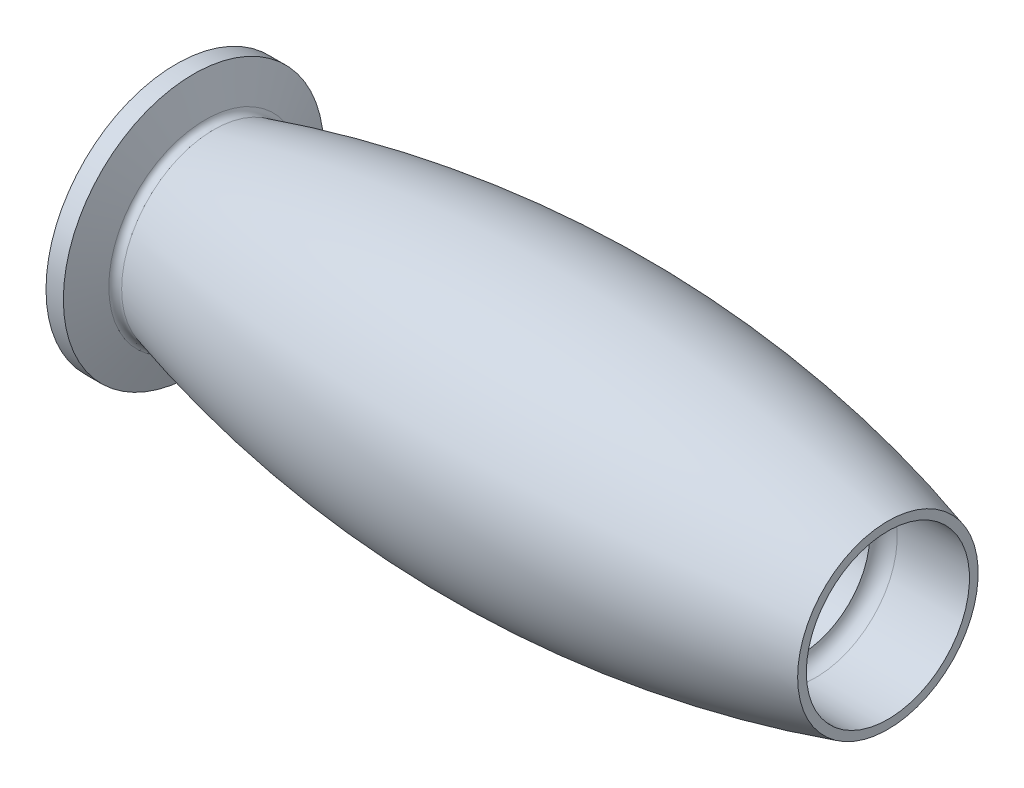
ISO-10303-21;
HEADER;
FILE_DESCRIPTION(('STEP AP214'),'2;1');
FILE_NAME('part.step','',(''),(''),'','','');
FILE_SCHEMA(('AUTOMOTIVE_DESIGN { 1 0 10303 214 1 1 1 1 }'));
ENDSEC;
DATA;
#1=APPLICATION_CONTEXT('core data for automotive mechanical design processes');
#2=APPLICATION_PROTOCOL_DEFINITION('international standard','automotive_design',2000,#1);
#3=PRODUCT_CONTEXT('',#1,'mechanical');
#4=PRODUCT('Part','Part','',(#3));
#5=PRODUCT_RELATED_PRODUCT_CATEGORY('part','',(#4));
#6=PRODUCT_DEFINITION_FORMATION('','',#4);
#7=PRODUCT_DEFINITION_CONTEXT('part definition',#1,'design');
#8=PRODUCT_DEFINITION('design','',#6,#7);
#9=PRODUCT_DEFINITION_SHAPE('','',#8);
#10=(LENGTH_UNIT() NAMED_UNIT(*) SI_UNIT(.MILLI.,.METRE.));
#11=(NAMED_UNIT(*) PLANE_ANGLE_UNIT() SI_UNIT($,.RADIAN.));
#12=(NAMED_UNIT(*) SI_UNIT($,.STERADIAN.) SOLID_ANGLE_UNIT());
#13=UNCERTAINTY_MEASURE_WITH_UNIT(LENGTH_MEASURE(1.E-05),#10,'distance_accuracy_value','');
#14=(GEOMETRIC_REPRESENTATION_CONTEXT(3) GLOBAL_UNCERTAINTY_ASSIGNED_CONTEXT((#13)) GLOBAL_UNIT_ASSIGNED_CONTEXT((#10,
#11,#12)) REPRESENTATION_CONTEXT('',''));
#15=CARTESIAN_POINT('',(0.,0.,0.));
#16=DIRECTION('',(0.,0.,1.));
#17=DIRECTION('',(1.,0.,0.));
#18=AXIS2_PLACEMENT_3D('',#15,#16,#17);
#19=CARTESIAN_POINT('',(-20.,0.,0.));
#20=DIRECTION('',(-1.,0.,0.));
#21=DIRECTION('',(0.,0.,1.));
#22=AXIS2_PLACEMENT_3D('',#19,#20,#21);
#23=CYLINDRICAL_SURFACE('',#22,12.);
#24=CARTESIAN_POINT('',(4.00000000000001,0.,0.));
#25=DIRECTION('',(-1.,0.,0.));
#26=DIRECTION('',(0.,0.,1.));
#27=AXIS2_PLACEMENT_3D('',#24,#25,#26);
#28=CIRCLE('',#27,12.);
#29=CARTESIAN_POINT('',(4.00000000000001,0.,12.));
#30=VERTEX_POINT('',#29);
#31=EDGE_CURVE('E48',#30,#30,#28,.T.);
#32=ORIENTED_EDGE('',*,*,#31,.T.);
#33=EDGE_LOOP('',(#32));
#34=FACE_BOUND('',#33,.T.);
#35=CARTESIAN_POINT('',(7.00000000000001,0.,0.));
#36=DIRECTION('',(-1.,0.,0.));
#37=DIRECTION('',(0.,0.,1.));
#38=AXIS2_PLACEMENT_3D('',#35,#36,#37);
#39=CIRCLE('',#38,12.);
#40=CARTESIAN_POINT('',(7.00000000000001,0.,12.));
#41=VERTEX_POINT('',#40);
#42=EDGE_CURVE('E86',#41,#41,#39,.T.);
#43=ORIENTED_EDGE('',*,*,#42,.F.);
#44=EDGE_LOOP('',(#43));
#45=FACE_BOUND('',#44,.T.);
#46=ADVANCED_FACE('F33',(#34,#45),#23,.F.);
#47=CARTESIAN_POINT('',(4.00000000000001,0.,0.));
#48=DIRECTION('',(1.,0.,0.));
#49=DIRECTION('',(0.,0.,-1.));
#50=AXIS2_PLACEMENT_3D('',#47,#48,#49);
#51=CONICAL_SURFACE('',#50,12.,1.21609067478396);
#52=CARTESIAN_POINT('',(6.50000000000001,0.,0.));
#53=DIRECTION('',(-1.,0.,0.));
#54=DIRECTION('',(0.,0.,1.));
#55=AXIS2_PLACEMENT_3D('',#52,#53,#54);
#56=CIRCLE('',#55,18.75);
#57=CARTESIAN_POINT('',(6.50000000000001,0.,18.75));
#58=VERTEX_POINT('',#57);
#59=EDGE_CURVE('E53',#58,#58,#56,.T.);
#60=ORIENTED_EDGE('',*,*,#59,.T.);
#61=EDGE_LOOP('',(#60));
#62=FACE_BOUND('',#61,.T.);
#63=ORIENTED_EDGE('',*,*,#31,.F.);
#64=EDGE_LOOP('',(#63));
#65=FACE_BOUND('',#64,.T.);
#66=ADVANCED_FACE('F94',(#62,#65),#51,.T.);
#67=CARTESIAN_POINT('',(-20.,0.,0.));
#68=DIRECTION('',(-1.,0.,0.));
#69=DIRECTION('',(0.,0.,1.));
#70=AXIS2_PLACEMENT_3D('',#67,#68,#69);
#71=CYLINDRICAL_SURFACE('',#70,18.75);
#72=CARTESIAN_POINT('',(9.00000000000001,0.,0.));
#73=DIRECTION('',(-1.,0.,0.));
#74=DIRECTION('',(0.,0.,1.));
#75=AXIS2_PLACEMENT_3D('',#72,#73,#74);
#76=CIRCLE('',#75,18.75);
#77=CARTESIAN_POINT('',(9.00000000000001,0.,18.75));
#78=VERTEX_POINT('',#77);
#79=EDGE_CURVE('E56',#78,#78,#76,.T.);
#80=ORIENTED_EDGE('',*,*,#79,.T.);
#81=EDGE_LOOP('',(#80));
#82=FACE_BOUND('',#81,.T.);
#83=ORIENTED_EDGE('',*,*,#59,.F.);
#84=EDGE_LOOP('',(#83));
#85=FACE_BOUND('',#84,.T.);
#86=ADVANCED_FACE('F100',(#82,#85),#71,.T.);
#87=CARTESIAN_POINT('',(9.00000000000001,0.,0.));
#88=DIRECTION('',(-1.,0.,0.));
#89=DIRECTION('',(0.,0.,1.));
#90=AXIS2_PLACEMENT_3D('',#87,#88,#89);
#91=CONICAL_SURFACE('',#90,18.75,1.23605948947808);
#92=CARTESIAN_POINT('',(10.6886470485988,0.,0.));
#93=DIRECTION('',(-1.,0.,0.));
#94=DIRECTION('',(0.,0.,1.));
#95=AXIS2_PLACEMENT_3D('',#92,#93,#94);
#96=CIRCLE('',#95,13.8951397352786);
#97=CARTESIAN_POINT('',(10.6886470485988,0.,13.8951397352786));
#98=VERTEX_POINT('',#97);
#99=EDGE_CURVE('E59',#98,#98,#96,.T.);
#100=ORIENTED_EDGE('',*,*,#99,.T.);
#101=EDGE_LOOP('',(#100));
#102=FACE_BOUND('',#101,.T.);
#103=ORIENTED_EDGE('',*,*,#79,.F.);
#104=EDGE_LOOP('',(#103));
#105=FACE_BOUND('',#104,.T.);
#106=ADVANCED_FACE('F158',(#102,#105),#91,.T.);
#107=CARTESIAN_POINT('',(11.6331438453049,0.,0.));
#108=DIRECTION('',(-1.,0.,0.));
#109=DIRECTION('',(0.,0.,1.));
#110=AXIS2_PLACEMENT_3D('',#107,#108,#109);
#111=TOROIDAL_SURFACE('',#110,14.2236603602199,1.00000000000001);
#112=CARTESIAN_POINT('',(11.907955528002,0.,0.));
#113=DIRECTION('',(-1.,0.,0.));
#114=DIRECTION('',(0.,0.,1.));
#115=AXIS2_PLACEMENT_3D('',#112,#113,#114);
#116=CIRCLE('',#115,13.2621622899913);
#117=CARTESIAN_POINT('',(11.907955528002,0.,13.2621622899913));
#118=VERTEX_POINT('',#117);
#119=EDGE_CURVE('E62',#118,#118,#116,.T.);
#120=ORIENTED_EDGE('',*,*,#119,.T.);
#121=EDGE_LOOP('',(#120));
#122=FACE_BOUND('',#121,.T.);
#123=ORIENTED_EDGE('',*,*,#99,.F.);
#124=EDGE_LOOP('',(#123));
#125=FACE_BOUND('',#124,.T.);
#126=ADVANCED_FACE('F154',(#122,#125),#111,.F.);
#127=CARTESIAN_POINT('',(60.,0.,0.));
#128=DIRECTION('',(-1.,0.,0.));
#129=DIRECTION('',(0.,0.,1.));
#130=AXIS2_PLACEMENT_3D('',#127,#128,#129);
#131=DEGENERATE_TOROIDAL_SURFACE('',#130,155.000000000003,175.000000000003,.F.);
#132=CARTESIAN_POINT('',(109.,0.,0.));
#133=DIRECTION('',(-1.,0.,0.));
#134=DIRECTION('',(0.,0.,1.));
#135=AXIS2_PLACEMENT_3D('',#132,#133,#134);
#136=CIRCLE('',#135,13.0000000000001);
#137=CARTESIAN_POINT('',(109.,0.,13.0000000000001));
#138=VERTEX_POINT('',#137);
#139=EDGE_CURVE('E65',#138,#138,#136,.T.);
#140=ORIENTED_EDGE('',*,*,#139,.T.);
#141=EDGE_LOOP('',(#140));
#142=FACE_BOUND('',#141,.T.);
#143=ORIENTED_EDGE('',*,*,#119,.F.);
#144=EDGE_LOOP('',(#143));
#145=FACE_BOUND('',#144,.T.);
#146=ADVANCED_FACE('F150',(#142,#145),#131,.F.);
#147=CARTESIAN_POINT('',(109.,-13.,0.));
#148=DIRECTION('',(1.,0.,0.));
#149=DIRECTION('',(0.,0.,-1.));
#150=AXIS2_PLACEMENT_3D('',#147,#148,#149);
#151=PLANE('',#150);
#152=CARTESIAN_POINT('',(109.,0.,0.));
#153=DIRECTION('',(-1.,0.,0.));
#154=DIRECTION('',(0.,0.,1.));
#155=AXIS2_PLACEMENT_3D('',#152,#153,#154);
#156=CIRCLE('',#155,11.75);
#157=CARTESIAN_POINT('',(109.,0.,11.75));
#158=VERTEX_POINT('',#157);
#159=EDGE_CURVE('E68',#158,#158,#156,.T.);
#160=ORIENTED_EDGE('',*,*,#159,.T.);
#161=EDGE_LOOP('',(#160));
#162=FACE_BOUND('',#161,.T.);
#163=ORIENTED_EDGE('',*,*,#139,.F.);
#164=EDGE_LOOP('',(#163));
#165=FACE_BOUND('',#164,.T.);
#166=ADVANCED_FACE('F145',(#162,#165),#151,.T.);
#167=CARTESIAN_POINT('',(-20.,0.,0.));
#168=DIRECTION('',(-1.,0.,0.));
#169=DIRECTION('',(0.,0.,1.));
#170=AXIS2_PLACEMENT_3D('',#167,#168,#169);
#171=CYLINDRICAL_SURFACE('',#170,11.75);
#172=CARTESIAN_POINT('',(98.593741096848,0.,0.));
#173=DIRECTION('',(-1.,0.,0.));
#174=DIRECTION('',(0.,0.,1.));
#175=AXIS2_PLACEMENT_3D('',#172,#173,#174);
#176=CIRCLE('',#175,11.75);
#177=CARTESIAN_POINT('',(98.593741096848,0.,11.75));
#178=VERTEX_POINT('',#177);
#179=EDGE_CURVE('E10',#178,#178,#176,.T.);
#180=ORIENTED_EDGE('',*,*,#179,.T.);
#181=EDGE_LOOP('',(#180));
#182=FACE_BOUND('',#181,.T.);
#183=ORIENTED_EDGE('',*,*,#159,.F.);
#184=EDGE_LOOP('',(#183));
#185=FACE_BOUND('',#184,.T.);
#186=ADVANCED_FACE('F138',(#182,#185),#171,.F.);
#187=CARTESIAN_POINT('',(-20.,0.,0.));
#188=DIRECTION('',(-1.,0.,0.));
#189=DIRECTION('',(0.,0.,1.));
#190=AXIS2_PLACEMENT_3D('',#187,#188,#189);
#191=CYLINDRICAL_SURFACE('',#190,10.);
#192=CARTESIAN_POINT('',(15.,0.,0.));
#193=DIRECTION('',(-1.,0.,0.));
#194=DIRECTION('',(0.,0.,1.));
#195=AXIS2_PLACEMENT_3D('',#192,#193,#194);
#196=CIRCLE('',#195,10.);
#197=CARTESIAN_POINT('',(15.,0.,10.));
#198=VERTEX_POINT('',#197);
#199=EDGE_CURVE('E74',#198,#198,#196,.T.);
#200=ORIENTED_EDGE('',*,*,#199,.T.);
#201=EDGE_LOOP('',(#200));
#202=FACE_BOUND('',#201,.T.);
#203=CARTESIAN_POINT('',(96.4,0.,0.));
#204=DIRECTION('',(-1.,0.,0.));
#205=DIRECTION('',(0.,0.,1.));
#206=AXIS2_PLACEMENT_3D('',#203,#204,#205);
#207=CIRCLE('',#206,10.);
#208=CARTESIAN_POINT('',(96.4,0.,10.));
#209=VERTEX_POINT('',#208);
#210=EDGE_CURVE('E71',#209,#209,#207,.T.);
#211=ORIENTED_EDGE('',*,*,#210,.F.);
#212=EDGE_LOOP('',(#211));
#213=FACE_BOUND('',#212,.T.);
#214=ADVANCED_FACE('F132',(#202,#213),#191,.F.);
#215=CARTESIAN_POINT('',(15.,-7.,0.));
#216=DIRECTION('',(1.,0.,0.));
#217=DIRECTION('',(0.,0.,-1.));
#218=AXIS2_PLACEMENT_3D('',#215,#216,#217);
#219=PLANE('',#218);
#220=CARTESIAN_POINT('',(15.,0.,0.));
#221=DIRECTION('',(-1.,0.,0.));
#222=DIRECTION('',(0.,0.,1.));
#223=AXIS2_PLACEMENT_3D('',#220,#221,#222);
#224=CIRCLE('',#223,7.);
#225=CARTESIAN_POINT('',(15.,0.,7.));
#226=VERTEX_POINT('',#225);
#227=EDGE_CURVE('E77',#226,#226,#224,.T.);
#228=ORIENTED_EDGE('',*,*,#227,.T.);
#229=EDGE_LOOP('',(#228));
#230=FACE_BOUND('',#229,.T.);
#231=ORIENTED_EDGE('',*,*,#199,.F.);
#232=EDGE_LOOP('',(#231));
#233=FACE_BOUND('',#232,.T.);
#234=ADVANCED_FACE('F126',(#230,#233),#219,.T.);
#235=CARTESIAN_POINT('',(-20.,0.,0.));
#236=DIRECTION('',(-1.,0.,0.));
#237=DIRECTION('',(0.,0.,1.));
#238=AXIS2_PLACEMENT_3D('',#235,#236,#237);
#239=CYLINDRICAL_SURFACE('',#238,7.);
#240=CARTESIAN_POINT('',(13.,0.,0.));
#241=DIRECTION('',(-1.,0.,0.));
#242=DIRECTION('',(0.,0.,1.));
#243=AXIS2_PLACEMENT_3D('',#240,#241,#242);
#244=CIRCLE('',#243,7.);
#245=CARTESIAN_POINT('',(13.,0.,7.));
#246=VERTEX_POINT('',#245);
#247=EDGE_CURVE('E80',#246,#246,#244,.T.);
#248=ORIENTED_EDGE('',*,*,#247,.T.);
#249=EDGE_LOOP('',(#248));
#250=FACE_BOUND('',#249,.T.);
#251=ORIENTED_EDGE('',*,*,#227,.F.);
#252=EDGE_LOOP('',(#251));
#253=FACE_BOUND('',#252,.T.);
#254=ADVANCED_FACE('F120',(#250,#253),#239,.F.);
#255=CARTESIAN_POINT('',(13.,-11.75,0.));
#256=DIRECTION('',(-1.,0.,0.));
#257=DIRECTION('',(0.,0.,1.));
#258=AXIS2_PLACEMENT_3D('',#255,#256,#257);
#259=PLANE('',#258);
#260=CARTESIAN_POINT('',(13.,0.,0.));
#261=DIRECTION('',(-1.,0.,0.));
#262=DIRECTION('',(0.,0.,1.));
#263=AXIS2_PLACEMENT_3D('',#260,#261,#262);
#264=CIRCLE('',#263,9.5);
#265=CARTESIAN_POINT('',(13.,0.,9.5));
#266=VERTEX_POINT('',#265);
#267=EDGE_CURVE('E44',#266,#266,#264,.T.);
#268=ORIENTED_EDGE('',*,*,#267,.T.);
#269=EDGE_LOOP('',(#268));
#270=FACE_BOUND('',#269,.T.);
#271=ORIENTED_EDGE('',*,*,#247,.F.);
#272=EDGE_LOOP('',(#271));
#273=FACE_BOUND('',#272,.T.);
#274=ADVANCED_FACE('F117',(#270,#273),#259,.T.);
#275=CARTESIAN_POINT('',(-20.,0.,0.));
#276=DIRECTION('',(-1.,0.,0.));
#277=DIRECTION('',(0.,0.,1.));
#278=AXIS2_PLACEMENT_3D('',#275,#276,#277);
#279=CYLINDRICAL_SURFACE('',#278,11.75);
#280=CARTESIAN_POINT('',(10.75,0.,0.));
#281=DIRECTION('',(-1.,0.,0.));
#282=DIRECTION('',(0.,0.,1.));
#283=AXIS2_PLACEMENT_3D('',#280,#281,#282);
#284=CIRCLE('',#283,11.75);
#285=CARTESIAN_POINT('',(10.75,0.,11.75));
#286=VERTEX_POINT('',#285);
#287=EDGE_CURVE('E40',#286,#286,#284,.F.);
#288=ORIENTED_EDGE('',*,*,#287,.T.);
#289=EDGE_LOOP('',(#288));
#290=FACE_BOUND('',#289,.T.);
#291=CARTESIAN_POINT('',(7.00000000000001,0.,0.));
#292=DIRECTION('',(-1.,0.,0.));
#293=DIRECTION('',(0.,0.,1.));
#294=AXIS2_PLACEMENT_3D('',#291,#292,#293);
#295=CIRCLE('',#294,11.75);
#296=CARTESIAN_POINT('',(7.00000000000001,0.,11.75));
#297=VERTEX_POINT('',#296);
#298=EDGE_CURVE('E83',#297,#297,#295,.T.);
#299=ORIENTED_EDGE('',*,*,#298,.T.);
#300=EDGE_LOOP('',(#299));
#301=FACE_BOUND('',#300,.T.);
#302=ADVANCED_FACE('F112',(#290,#301),#279,.F.);
#303=CARTESIAN_POINT('',(7.00000000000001,-12.,0.));
#304=DIRECTION('',(-1.,0.,0.));
#305=DIRECTION('',(0.,0.,1.));
#306=AXIS2_PLACEMENT_3D('',#303,#304,#305);
#307=PLANE('',#306);
#308=ORIENTED_EDGE('',*,*,#42,.T.);
#309=EDGE_LOOP('',(#308));
#310=FACE_BOUND('',#309,.T.);
#311=ORIENTED_EDGE('',*,*,#298,.F.);
#312=EDGE_LOOP('',(#311));
#313=FACE_BOUND('',#312,.T.);
#314=ADVANCED_FACE('F90',(#310,#313),#307,.T.);
#315=CARTESIAN_POINT('',(10.75,0.,0.));
#316=DIRECTION('',(-1.,0.,0.));
#317=DIRECTION('',(0.,0.,1.));
#318=AXIS2_PLACEMENT_3D('',#315,#316,#317);
#319=TOROIDAL_SURFACE('',#318,9.5,2.25);
#320=ORIENTED_EDGE('',*,*,#287,.F.);
#321=EDGE_LOOP('',(#320));
#322=FACE_BOUND('',#321,.T.);
#323=ORIENTED_EDGE('',*,*,#267,.F.);
#324=EDGE_LOOP('',(#323));
#325=FACE_BOUND('',#324,.T.);
#326=ADVANCED_FACE('F104',(#322,#325),#319,.F.);
#327=CARTESIAN_POINT('',(98.593741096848,0.,0.));
#328=DIRECTION('',(-1.,0.,0.));
#329=DIRECTION('',(0.,0.,1.));
#330=AXIS2_PLACEMENT_3D('',#327,#328,#329);
#331=TOROIDAL_SURFACE('',#330,9.5,2.25);
#332=ORIENTED_EDGE('',*,*,#210,.T.);
#333=EDGE_LOOP('',(#332));
#334=FACE_BOUND('',#333,.T.);
#335=ORIENTED_EDGE('',*,*,#179,.F.);
#336=EDGE_LOOP('',(#335));
#337=FACE_BOUND('',#336,.T.);
#338=ADVANCED_FACE('F35',(#334,#337),#331,.F.);
#339=CLOSED_SHELL('',(#46,#66,#86,#106,#126,#146,#166,#186,#214,#234,#254,#274,#302,#314,#326,#338));
#340=MANIFOLD_SOLID_BREP('B2',#339);
#341=ADVANCED_BREP_SHAPE_REPRESENTATION('',(#18,#340),#14);
#342=SHAPE_DEFINITION_REPRESENTATION(#9,#341);
ENDSEC;
END-ISO-10303-21;
